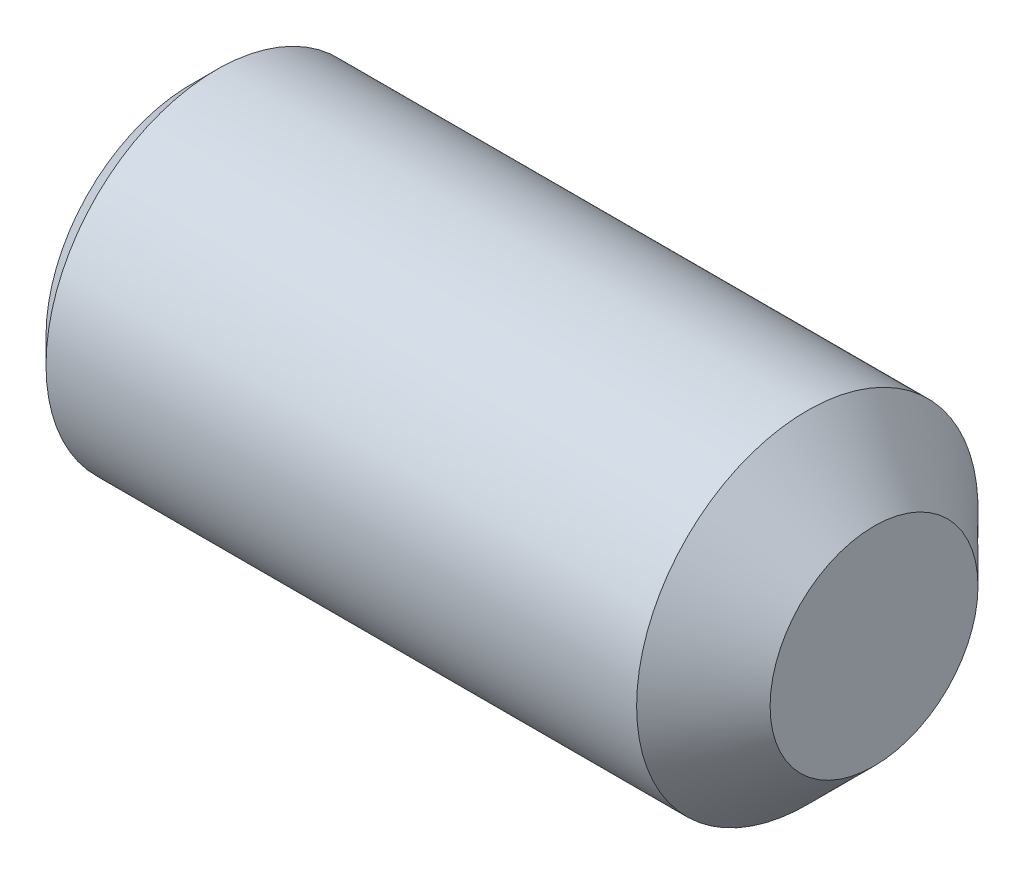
from build123d import *

# Parameters (mm, degrees)
HEX_2_DEPTH = 14.2748


with BuildPart() as part:
    # BodySke → BaseBody (revolve)
    with BuildSketch(Plane.XY, mode=Mode.PRIVATE) as basebody_sk:
        Polygon((0, 0), (0, 10.81024), (1.88976, 12.7), (45.8343, 12.7), (50.8, 7.7343), (50.8, 0), align=None)
    revolve(basebody_sk.sketch.rotate(Axis((-12.7, 0, 0), (1, 0, 0)), 90), axis=Axis((-12.7, 0, 0), (1, 0, 0)))

    # Sketch2 → Hex 2 (cut)
    with BuildSketch(Plane.ZY):
        Polygon((4.120779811, 7.1374), (-4.120779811, 7.1374), (-8.241559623, 0), (-4.120779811, -7.1374), (4.120779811, -7.1374), (8.241559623, 0), align=None)
    extrude(amount=-HEX_2_DEPTH, mode=Mode.SUBTRACT)


solid = part.part
